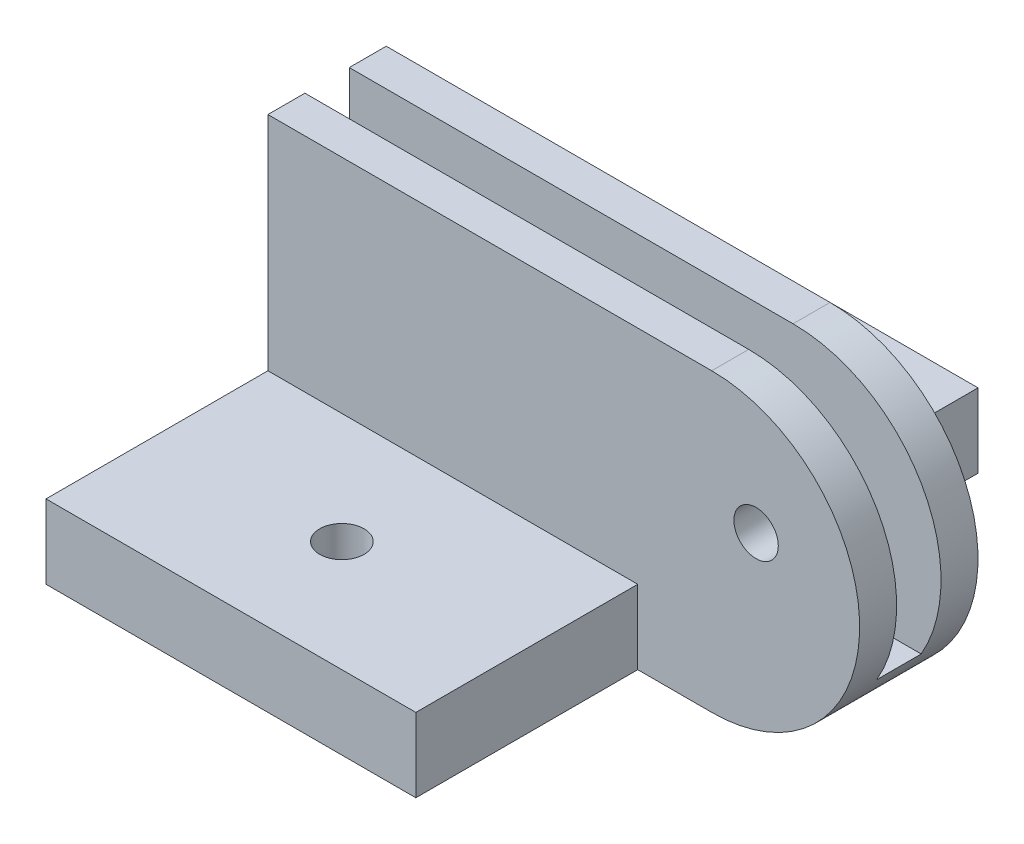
ISO-10303-21;
HEADER;
FILE_DESCRIPTION(('STEP AP214'),'2;1');
FILE_NAME('part.step','',(''),(''),'','','');
FILE_SCHEMA(('AUTOMOTIVE_DESIGN { 1 0 10303 214 1 1 1 1 }'));
ENDSEC;
DATA;
#1=APPLICATION_CONTEXT('core data for automotive mechanical design processes');
#2=APPLICATION_PROTOCOL_DEFINITION('international standard','automotive_design',2000,#1);
#3=PRODUCT_CONTEXT('',#1,'mechanical');
#4=PRODUCT('Part','Part','',(#3));
#5=PRODUCT_RELATED_PRODUCT_CATEGORY('part','',(#4));
#6=PRODUCT_DEFINITION_FORMATION('','',#4);
#7=PRODUCT_DEFINITION_CONTEXT('part definition',#1,'design');
#8=PRODUCT_DEFINITION('design','',#6,#7);
#9=PRODUCT_DEFINITION_SHAPE('','',#8);
#10=(LENGTH_UNIT() NAMED_UNIT(*) SI_UNIT(.MILLI.,.METRE.));
#11=(NAMED_UNIT(*) PLANE_ANGLE_UNIT() SI_UNIT($,.RADIAN.));
#12=(NAMED_UNIT(*) SI_UNIT($,.STERADIAN.) SOLID_ANGLE_UNIT());
#13=UNCERTAINTY_MEASURE_WITH_UNIT(LENGTH_MEASURE(1.E-05),#10,'distance_accuracy_value','');
#14=(GEOMETRIC_REPRESENTATION_CONTEXT(3) GLOBAL_UNCERTAINTY_ASSIGNED_CONTEXT((#13)) GLOBAL_UNIT_ASSIGNED_CONTEXT((#10,
#11,#12)) REPRESENTATION_CONTEXT('',''));
#15=CARTESIAN_POINT('',(0.,0.,0.));
#16=DIRECTION('',(0.,0.,1.));
#17=DIRECTION('',(1.,0.,0.));
#18=AXIS2_PLACEMENT_3D('',#15,#16,#17);
#19=CARTESIAN_POINT('',(-30.,10.,8.));
#20=DIRECTION('',(0.,-1.,0.));
#21=DIRECTION('',(0.,0.,-1.));
#22=AXIS2_PLACEMENT_3D('',#19,#20,#21);
#23=PLANE('',#22);
#24=DIRECTION('',(0.,0.,-1.));
#25=VECTOR('',#24,1.);
#26=CARTESIAN_POINT('',(0.,10.,8.));
#27=LINE('',#26,#25);
#28=CARTESIAN_POINT('',(0.,10.,8.));
#29=VERTEX_POINT('',#28);
#30=CARTESIAN_POINT('',(0.,10.,5.5));
#31=VERTEX_POINT('',#30);
#32=EDGE_CURVE('E240',#29,#31,#27,.T.);
#33=ORIENTED_EDGE('',*,*,#32,.T.);
#34=DIRECTION('',(1.,0.,0.));
#35=VECTOR('',#34,1.);
#36=CARTESIAN_POINT('',(10.,10.,5.5));
#37=LINE('',#36,#35);
#38=CARTESIAN_POINT('',(-30.,10.,5.50000000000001));
#39=VERTEX_POINT('',#38);
#40=EDGE_CURVE('E145',#39,#31,#37,.T.);
#41=ORIENTED_EDGE('',*,*,#40,.F.);
#42=DIRECTION('',(0.,0.,-1.));
#43=VECTOR('',#42,1.);
#44=CARTESIAN_POINT('',(-30.,10.,8.));
#45=LINE('',#44,#43);
#46=CARTESIAN_POINT('',(-30.,10.,8.));
#47=VERTEX_POINT('',#46);
#48=EDGE_CURVE('E237',#47,#39,#45,.T.);
#49=ORIENTED_EDGE('',*,*,#48,.F.);
#50=DIRECTION('',(-1.,0.,0.));
#51=VECTOR('',#50,1.);
#52=CARTESIAN_POINT('',(-30.,10.,8.));
#53=LINE('',#52,#51);
#54=EDGE_CURVE('E225',#29,#47,#53,.T.);
#55=ORIENTED_EDGE('',*,*,#54,.F.);
#56=EDGE_LOOP('',(#33,#41,#49,#55));
#57=FACE_BOUND('',#56,.T.);
#58=ADVANCED_FACE('F36',(#57),#23,.F.);
#59=CARTESIAN_POINT('',(0.,0.,0.));
#60=DIRECTION('',(0.,0.,1.));
#61=DIRECTION('',(1.,0.,0.));
#62=AXIS2_PLACEMENT_3D('',#59,#60,#61);
#63=PLANE('',#62);
#64=CARTESIAN_POINT('',(3.,2.,0.));
#65=DIRECTION('',(0.,0.,1.));
#66=DIRECTION('',(1.,0.,0.));
#67=AXIS2_PLACEMENT_3D('',#64,#65,#66);
#68=CIRCLE('',#67,1.5);
#69=CARTESIAN_POINT('',(4.5,2.,0.));
#70=VERTEX_POINT('',#69);
#71=EDGE_CURVE('E163',#70,#70,#68,.T.);
#72=ORIENTED_EDGE('',*,*,#71,.T.);
#73=EDGE_LOOP('',(#72));
#74=FACE_BOUND('',#73,.T.);
#75=DIRECTION('',(0.,-1.,0.));
#76=VECTOR('',#75,1.);
#77=CARTESIAN_POINT('',(-5.,-5.,0.));
#78=LINE('',#77,#76);
#79=CARTESIAN_POINT('',(-5.,-5.,0.));
#80=VERTEX_POINT('',#79);
#81=CARTESIAN_POINT('',(-5.,-10.,0.));
#82=VERTEX_POINT('',#81);
#83=EDGE_CURVE('E188',#80,#82,#78,.T.);
#84=ORIENTED_EDGE('',*,*,#83,.F.);
#85=DIRECTION('',(-1.,0.,0.));
#86=VECTOR('',#85,1.);
#87=CARTESIAN_POINT('',(-30.,-5.,0.));
#88=LINE('',#87,#86);
#89=CARTESIAN_POINT('',(-30.,-5.,0.));
#90=VERTEX_POINT('',#89);
#91=EDGE_CURVE('E176',#80,#90,#88,.T.);
#92=ORIENTED_EDGE('',*,*,#91,.T.);
#93=DIRECTION('',(0.,-1.,0.));
#94=VECTOR('',#93,1.);
#95=CARTESIAN_POINT('',(-30.,10.,0.));
#96=LINE('',#95,#94);
#97=CARTESIAN_POINT('',(-30.,10.,0.));
#98=VERTEX_POINT('',#97);
#99=EDGE_CURVE('E212',#98,#90,#96,.T.);
#100=ORIENTED_EDGE('',*,*,#99,.F.);
#101=DIRECTION('',(-1.,0.,0.));
#102=VECTOR('',#101,1.);
#103=CARTESIAN_POINT('',(-30.,10.,0.));
#104=LINE('',#103,#102);
#105=CARTESIAN_POINT('',(0.,10.,0.));
#106=VERTEX_POINT('',#105);
#107=EDGE_CURVE('E221',#106,#98,#104,.T.);
#108=ORIENTED_EDGE('',*,*,#107,.F.);
#109=CARTESIAN_POINT('',(0.,0.,0.));
#110=DIRECTION('',(0.,0.,1.));
#111=DIRECTION('',(1.,0.,0.));
#112=AXIS2_PLACEMENT_3D('',#109,#110,#111);
#113=CIRCLE('',#112,10.);
#114=CARTESIAN_POINT('',(0.,-10.,0.));
#115=VERTEX_POINT('',#114);
#116=EDGE_CURVE('E232',#115,#106,#113,.T.);
#117=ORIENTED_EDGE('',*,*,#116,.F.);
#118=DIRECTION('',(1.,0.,0.));
#119=VECTOR('',#118,1.);
#120=CARTESIAN_POINT('',(-30.,-10.,0.));
#121=LINE('',#120,#119);
#122=EDGE_CURVE('E230',#82,#115,#121,.T.);
#123=ORIENTED_EDGE('',*,*,#122,.F.);
#124=EDGE_LOOP('',(#84,#92,#100,#108,#117,#123));
#125=FACE_BOUND('',#124,.T.);
#126=ADVANCED_FACE('F261',(#74,#125),#63,.F.);
#127=CARTESIAN_POINT('',(0.,0.,8.));
#128=DIRECTION('',(0.,0.,1.));
#129=DIRECTION('',(1.,0.,0.));
#130=AXIS2_PLACEMENT_3D('',#127,#128,#129);
#131=PLANE('',#130);
#132=CARTESIAN_POINT('',(3.,2.,8.));
#133=DIRECTION('',(0.,0.,1.));
#134=DIRECTION('',(1.,0.,0.));
#135=AXIS2_PLACEMENT_3D('',#132,#133,#134);
#136=CIRCLE('',#135,1.5);
#137=CARTESIAN_POINT('',(4.5,2.,8.));
#138=VERTEX_POINT('',#137);
#139=EDGE_CURVE('E341',#138,#138,#136,.T.);
#140=ORIENTED_EDGE('',*,*,#139,.F.);
#141=EDGE_LOOP('',(#140));
#142=FACE_BOUND('',#141,.T.);
#143=DIRECTION('',(0.,-1.,0.));
#144=VECTOR('',#143,1.);
#145=CARTESIAN_POINT('',(-30.,10.,8.));
#146=LINE('',#145,#144);
#147=CARTESIAN_POINT('',(-30.,-5.,8.));
#148=VERTEX_POINT('',#147);
#149=EDGE_CURVE('E217',#47,#148,#146,.T.);
#150=ORIENTED_EDGE('',*,*,#149,.T.);
#151=DIRECTION('',(1.,0.,0.));
#152=VECTOR('',#151,1.);
#153=CARTESIAN_POINT('',(-5.,-5.,8.));
#154=LINE('',#153,#152);
#155=CARTESIAN_POINT('',(-5.,-5.,8.));
#156=VERTEX_POINT('',#155);
#157=EDGE_CURVE('E194',#148,#156,#154,.T.);
#158=ORIENTED_EDGE('',*,*,#157,.T.);
#159=DIRECTION('',(0.,-1.,0.));
#160=VECTOR('',#159,1.);
#161=CARTESIAN_POINT('',(-5.,-5.,8.));
#162=LINE('',#161,#160);
#163=CARTESIAN_POINT('',(-5.,-10.,8.));
#164=VERTEX_POINT('',#163);
#165=EDGE_CURVE('E204',#156,#164,#162,.T.);
#166=ORIENTED_EDGE('',*,*,#165,.T.);
#167=DIRECTION('',(1.,0.,0.));
#168=VECTOR('',#167,1.);
#169=CARTESIAN_POINT('',(-30.,-10.,8.));
#170=LINE('',#169,#168);
#171=CARTESIAN_POINT('',(0.,-10.,8.));
#172=VERTEX_POINT('',#171);
#173=EDGE_CURVE('E220',#164,#172,#170,.T.);
#174=ORIENTED_EDGE('',*,*,#173,.T.);
#175=CARTESIAN_POINT('',(0.,0.,8.));
#176=DIRECTION('',(0.,0.,1.));
#177=DIRECTION('',(1.,0.,0.));
#178=AXIS2_PLACEMENT_3D('',#175,#176,#177);
#179=CIRCLE('',#178,10.);
#180=EDGE_CURVE('E223',#172,#29,#179,.T.);
#181=ORIENTED_EDGE('',*,*,#180,.T.);
#182=ORIENTED_EDGE('',*,*,#54,.T.);
#183=EDGE_LOOP('',(#150,#158,#166,#174,#181,#182));
#184=FACE_BOUND('',#183,.T.);
#185=ADVANCED_FACE('F279',(#142,#184),#131,.T.);
#186=CARTESIAN_POINT('',(-30.,10.,8.));
#187=DIRECTION('',(1.,0.,0.));
#188=DIRECTION('',(0.,1.,0.));
#189=AXIS2_PLACEMENT_3D('',#186,#187,#188);
#190=PLANE('',#189);
#191=ORIENTED_EDGE('',*,*,#48,.T.);
#192=DIRECTION('',(0.,1.,0.));
#193=VECTOR('',#192,1.);
#194=CARTESIAN_POINT('',(-30.,-5.,5.50000000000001));
#195=LINE('',#194,#193);
#196=CARTESIAN_POINT('',(-30.,-5.,5.50000000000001));
#197=VERTEX_POINT('',#196);
#198=EDGE_CURVE('E152',#197,#39,#195,.T.);
#199=ORIENTED_EDGE('',*,*,#198,.F.);
#200=DIRECTION('',(0.,0.,1.));
#201=VECTOR('',#200,1.);
#202=CARTESIAN_POINT('',(-30.,-5.,5.50000000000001));
#203=LINE('',#202,#201);
#204=CARTESIAN_POINT('',(-30.,-5.,2.50000000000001));
#205=VERTEX_POINT('',#204);
#206=EDGE_CURVE('E142',#205,#197,#203,.T.);
#207=ORIENTED_EDGE('',*,*,#206,.F.);
#208=DIRECTION('',(0.,1.,0.));
#209=VECTOR('',#208,1.);
#210=CARTESIAN_POINT('',(-30.,-5.,2.50000000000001));
#211=LINE('',#210,#209);
#212=CARTESIAN_POINT('',(-30.,10.,2.50000000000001));
#213=VERTEX_POINT('',#212);
#214=EDGE_CURVE('E148',#205,#213,#211,.T.);
#215=ORIENTED_EDGE('',*,*,#214,.T.);
#216=EDGE_CURVE('E227',#213,#98,#45,.T.);
#217=ORIENTED_EDGE('',*,*,#216,.T.);
#218=ORIENTED_EDGE('',*,*,#99,.T.);
#219=DIRECTION('',(0.,0.,-1.));
#220=VECTOR('',#219,1.);
#221=CARTESIAN_POINT('',(-30.,-5.,0.));
#222=LINE('',#221,#220);
#223=CARTESIAN_POINT('',(-30.,-5.,-15.));
#224=VERTEX_POINT('',#223);
#225=EDGE_CURVE('E60',#90,#224,#222,.T.);
#226=ORIENTED_EDGE('',*,*,#225,.T.);
#227=DIRECTION('',(0.,-1.,0.));
#228=VECTOR('',#227,1.);
#229=CARTESIAN_POINT('',(-30.,-5.,-15.));
#230=LINE('',#229,#228);
#231=CARTESIAN_POINT('',(-30.,-10.,-15.));
#232=VERTEX_POINT('',#231);
#233=EDGE_CURVE('E184',#224,#232,#230,.T.);
#234=ORIENTED_EDGE('',*,*,#233,.T.);
#235=DIRECTION('',(0.,0.,-1.));
#236=VECTOR('',#235,1.);
#237=CARTESIAN_POINT('',(-30.,-10.,8.));
#238=LINE('',#237,#236);
#239=CARTESIAN_POINT('',(-30.,-10.,23.));
#240=VERTEX_POINT('',#239);
#241=EDGE_CURVE('E246',#240,#232,#238,.T.);
#242=ORIENTED_EDGE('',*,*,#241,.F.);
#243=DIRECTION('',(0.,-1.,0.));
#244=VECTOR('',#243,1.);
#245=CARTESIAN_POINT('',(-30.,-5.,23.));
#246=LINE('',#245,#244);
#247=CARTESIAN_POINT('',(-30.,-5.,23.));
#248=VERTEX_POINT('',#247);
#249=EDGE_CURVE('E209',#248,#240,#246,.T.);
#250=ORIENTED_EDGE('',*,*,#249,.F.);
#251=DIRECTION('',(0.,0.,-1.));
#252=VECTOR('',#251,1.);
#253=CARTESIAN_POINT('',(-30.,-5.,23.));
#254=LINE('',#253,#252);
#255=EDGE_CURVE('E191',#248,#148,#254,.T.);
#256=ORIENTED_EDGE('',*,*,#255,.T.);
#257=ORIENTED_EDGE('',*,*,#149,.F.);
#258=EDGE_LOOP('',(#191,#199,#207,#215,#217,#218,#226,#234,#242,#250,#256,#257));
#259=FACE_BOUND('',#258,.T.);
#260=ADVANCED_FACE('F38',(#259),#190,.F.);
#261=CARTESIAN_POINT('',(-30.,-10.,8.));
#262=DIRECTION('',(0.,1.,0.));
#263=DIRECTION('',(0.,0.,1.));
#264=AXIS2_PLACEMENT_3D('',#261,#262,#263);
#265=PLANE('',#264);
#266=CARTESIAN_POINT('',(-17.5,-10.,-7.5));
#267=DIRECTION('',(0.,1.,0.));
#268=DIRECTION('',(0.,0.,1.));
#269=AXIS2_PLACEMENT_3D('',#266,#267,#268);
#270=CIRCLE('',#269,1.5);
#271=CARTESIAN_POINT('',(-17.5,-10.,-6.));
#272=VERTEX_POINT('',#271);
#273=EDGE_CURVE('E327',#272,#272,#270,.T.);
#274=ORIENTED_EDGE('',*,*,#273,.T.);
#275=EDGE_LOOP('',(#274));
#276=FACE_BOUND('',#275,.T.);
#277=CARTESIAN_POINT('',(-17.5,-10.,15.5));
#278=DIRECTION('',(0.,1.,0.));
#279=DIRECTION('',(0.,0.,1.));
#280=AXIS2_PLACEMENT_3D('',#277,#278,#279);
#281=CIRCLE('',#280,1.5);
#282=CARTESIAN_POINT('',(-17.5,-10.,17.));
#283=VERTEX_POINT('',#282);
#284=EDGE_CURVE('E330',#283,#283,#281,.T.);
#285=ORIENTED_EDGE('',*,*,#284,.T.);
#286=EDGE_LOOP('',(#285));
#287=FACE_BOUND('',#286,.T.);
#288=ORIENTED_EDGE('',*,*,#241,.T.);
#289=DIRECTION('',(1.,0.,0.));
#290=VECTOR('',#289,1.);
#291=CARTESIAN_POINT('',(-30.,-10.,-15.));
#292=LINE('',#291,#290);
#293=CARTESIAN_POINT('',(-5.,-10.,-15.));
#294=VERTEX_POINT('',#293);
#295=EDGE_CURVE('E168',#232,#294,#292,.T.);
#296=ORIENTED_EDGE('',*,*,#295,.T.);
#297=DIRECTION('',(0.,0.,1.));
#298=VECTOR('',#297,1.);
#299=CARTESIAN_POINT('',(-5.,-10.,0.));
#300=LINE('',#299,#298);
#301=EDGE_CURVE('E173',#294,#82,#300,.T.);
#302=ORIENTED_EDGE('',*,*,#301,.T.);
#303=ORIENTED_EDGE('',*,*,#122,.T.);
#304=DIRECTION('',(0.,0.,-1.));
#305=VECTOR('',#304,1.);
#306=CARTESIAN_POINT('',(0.,-10.,8.));
#307=LINE('',#306,#305);
#308=EDGE_CURVE('E243',#172,#115,#307,.T.);
#309=ORIENTED_EDGE('',*,*,#308,.F.);
#310=ORIENTED_EDGE('',*,*,#173,.F.);
#311=DIRECTION('',(0.,0.,1.));
#312=VECTOR('',#311,1.);
#313=CARTESIAN_POINT('',(-5.,-10.,23.));
#314=LINE('',#313,#312);
#315=CARTESIAN_POINT('',(-5.,-10.,23.));
#316=VERTEX_POINT('',#315);
#317=EDGE_CURVE('E187',#164,#316,#314,.T.);
#318=ORIENTED_EDGE('',*,*,#317,.T.);
#319=DIRECTION('',(-1.,0.,0.));
#320=VECTOR('',#319,1.);
#321=CARTESIAN_POINT('',(-30.,-10.,23.));
#322=LINE('',#321,#320);
#323=EDGE_CURVE('E195',#316,#240,#322,.T.);
#324=ORIENTED_EDGE('',*,*,#323,.T.);
#325=EDGE_LOOP('',(#288,#296,#302,#303,#309,#310,#318,#324));
#326=FACE_BOUND('',#325,.T.);
#327=ADVANCED_FACE('F267',(#276,#287,#326),#265,.F.);
#328=CARTESIAN_POINT('',(0.,0.,8.));
#329=DIRECTION('',(0.,0.,-1.));
#330=DIRECTION('',(-1.,0.,0.));
#331=AXIS2_PLACEMENT_3D('',#328,#329,#330);
#332=CYLINDRICAL_SURFACE('',#331,10.);
#333=CARTESIAN_POINT('',(0.,0.,5.5));
#334=DIRECTION('',(0.,0.,1.));
#335=DIRECTION('',(1.,0.,0.));
#336=AXIS2_PLACEMENT_3D('',#333,#334,#335);
#337=CIRCLE('',#336,10.);
#338=CARTESIAN_POINT('',(8.66025403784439,-5.,5.5));
#339=VERTEX_POINT('',#338);
#340=EDGE_CURVE('E166',#339,#31,#337,.T.);
#341=ORIENTED_EDGE('',*,*,#340,.T.);
#342=ORIENTED_EDGE('',*,*,#32,.F.);
#343=ORIENTED_EDGE('',*,*,#180,.F.);
#344=ORIENTED_EDGE('',*,*,#308,.T.);
#345=ORIENTED_EDGE('',*,*,#116,.T.);
#346=CARTESIAN_POINT('',(0.,10.,2.5));
#347=VERTEX_POINT('',#346);
#348=EDGE_CURVE('E239',#347,#106,#27,.T.);
#349=ORIENTED_EDGE('',*,*,#348,.F.);
#350=CARTESIAN_POINT('',(0.,0.,2.5));
#351=DIRECTION('',(0.,0.,-1.));
#352=DIRECTION('',(-1.,0.,0.));
#353=AXIS2_PLACEMENT_3D('',#350,#351,#352);
#354=CIRCLE('',#353,10.);
#355=CARTESIAN_POINT('',(8.66025403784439,-5.,2.5));
#356=VERTEX_POINT('',#355);
#357=EDGE_CURVE('E52',#347,#356,#354,.T.);
#358=ORIENTED_EDGE('',*,*,#357,.T.);
#359=DIRECTION('',(0.,0.,-1.));
#360=VECTOR('',#359,1.);
#361=CARTESIAN_POINT('',(8.66025403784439,-5.,8.));
#362=LINE('',#361,#360);
#363=EDGE_CURVE('E11',#339,#356,#362,.T.);
#364=ORIENTED_EDGE('',*,*,#363,.F.);
#365=EDGE_LOOP('',(#341,#342,#343,#344,#345,#349,#358,#364));
#366=FACE_BOUND('',#365,.T.);
#367=ADVANCED_FACE('F252',(#366),#332,.T.);
#368=ORIENTED_EDGE('',*,*,#216,.F.);
#369=DIRECTION('',(1.,0.,0.));
#370=VECTOR('',#369,1.);
#371=CARTESIAN_POINT('',(-30.,10.,2.50000000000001));
#372=LINE('',#371,#370);
#373=EDGE_CURVE('E45',#213,#347,#372,.T.);
#374=ORIENTED_EDGE('',*,*,#373,.T.);
#375=ORIENTED_EDGE('',*,*,#348,.T.);
#376=ORIENTED_EDGE('',*,*,#107,.T.);
#377=EDGE_LOOP('',(#368,#374,#375,#376));
#378=FACE_BOUND('',#377,.T.);
#379=ADVANCED_FACE('F250',(#378),#23,.F.);
#380=CARTESIAN_POINT('',(-30.,-5.,23.));
#381=DIRECTION('',(0.,0.,1.));
#382=DIRECTION('',(1.,0.,0.));
#383=AXIS2_PLACEMENT_3D('',#380,#381,#382);
#384=PLANE('',#383);
#385=ORIENTED_EDGE('',*,*,#323,.F.);
#386=DIRECTION('',(0.,-1.,0.));
#387=VECTOR('',#386,1.);
#388=CARTESIAN_POINT('',(-5.,-5.,23.));
#389=LINE('',#388,#387);
#390=CARTESIAN_POINT('',(-5.,-5.,23.));
#391=VERTEX_POINT('',#390);
#392=EDGE_CURVE('E213',#391,#316,#389,.T.);
#393=ORIENTED_EDGE('',*,*,#392,.F.);
#394=DIRECTION('',(-1.,0.,0.));
#395=VECTOR('',#394,1.);
#396=CARTESIAN_POINT('',(-30.,-5.,23.));
#397=LINE('',#396,#395);
#398=EDGE_CURVE('E201',#391,#248,#397,.T.);
#399=ORIENTED_EDGE('',*,*,#398,.T.);
#400=ORIENTED_EDGE('',*,*,#249,.T.);
#401=EDGE_LOOP('',(#385,#393,#399,#400));
#402=FACE_BOUND('',#401,.T.);
#403=ADVANCED_FACE('F271',(#402),#384,.T.);
#404=CARTESIAN_POINT('',(-5.,-5.,23.));
#405=DIRECTION('',(1.,0.,0.));
#406=DIRECTION('',(0.,0.,-1.));
#407=AXIS2_PLACEMENT_3D('',#404,#405,#406);
#408=PLANE('',#407);
#409=ORIENTED_EDGE('',*,*,#317,.F.);
#410=ORIENTED_EDGE('',*,*,#165,.F.);
#411=DIRECTION('',(0.,0.,1.));
#412=VECTOR('',#411,1.);
#413=CARTESIAN_POINT('',(-5.,-5.,23.));
#414=LINE('',#413,#412);
#415=EDGE_CURVE('E198',#156,#391,#414,.T.);
#416=ORIENTED_EDGE('',*,*,#415,.T.);
#417=ORIENTED_EDGE('',*,*,#392,.T.);
#418=EDGE_LOOP('',(#409,#410,#416,#417));
#419=FACE_BOUND('',#418,.T.);
#420=ADVANCED_FACE('F315',(#419),#408,.T.);
#421=CARTESIAN_POINT('',(0.,-5.,0.));
#422=DIRECTION('',(0.,1.,0.));
#423=DIRECTION('',(0.,0.,1.));
#424=AXIS2_PLACEMENT_3D('',#421,#422,#423);
#425=PLANE('',#424);
#426=CARTESIAN_POINT('',(-17.5,-5.,15.5));
#427=DIRECTION('',(0.,1.,0.));
#428=DIRECTION('',(0.,0.,1.));
#429=AXIS2_PLACEMENT_3D('',#426,#427,#428);
#430=CIRCLE('',#429,1.5);
#431=CARTESIAN_POINT('',(-17.5,-5.,17.));
#432=VERTEX_POINT('',#431);
#433=EDGE_CURVE('E333',#432,#432,#430,.T.);
#434=ORIENTED_EDGE('',*,*,#433,.F.);
#435=EDGE_LOOP('',(#434));
#436=FACE_BOUND('',#435,.T.);
#437=ORIENTED_EDGE('',*,*,#255,.F.);
#438=ORIENTED_EDGE('',*,*,#398,.F.);
#439=ORIENTED_EDGE('',*,*,#415,.F.);
#440=ORIENTED_EDGE('',*,*,#157,.F.);
#441=EDGE_LOOP('',(#437,#438,#439,#440));
#442=FACE_BOUND('',#441,.T.);
#443=ADVANCED_FACE('F276',(#436,#442),#425,.T.);
#444=CARTESIAN_POINT('',(-30.,-5.,-15.));
#445=DIRECTION('',(0.,0.,-1.));
#446=DIRECTION('',(-1.,0.,0.));
#447=AXIS2_PLACEMENT_3D('',#444,#445,#446);
#448=PLANE('',#447);
#449=ORIENTED_EDGE('',*,*,#295,.F.);
#450=ORIENTED_EDGE('',*,*,#233,.F.);
#451=DIRECTION('',(1.,0.,0.));
#452=VECTOR('',#451,1.);
#453=CARTESIAN_POINT('',(-30.,-5.,-15.));
#454=LINE('',#453,#452);
#455=CARTESIAN_POINT('',(-5.,-5.,-15.));
#456=VERTEX_POINT('',#455);
#457=EDGE_CURVE('E169',#224,#456,#454,.T.);
#458=ORIENTED_EDGE('',*,*,#457,.T.);
#459=DIRECTION('',(0.,-1.,0.));
#460=VECTOR('',#459,1.);
#461=CARTESIAN_POINT('',(-5.,-5.,-15.));
#462=LINE('',#461,#460);
#463=EDGE_CURVE('E179',#456,#294,#462,.T.);
#464=ORIENTED_EDGE('',*,*,#463,.T.);
#465=EDGE_LOOP('',(#449,#450,#458,#464));
#466=FACE_BOUND('',#465,.T.);
#467=ADVANCED_FACE('F264',(#466),#448,.T.);
#468=CARTESIAN_POINT('',(-5.,-5.,0.));
#469=DIRECTION('',(1.,0.,0.));
#470=DIRECTION('',(0.,0.,-1.));
#471=AXIS2_PLACEMENT_3D('',#468,#469,#470);
#472=PLANE('',#471);
#473=ORIENTED_EDGE('',*,*,#301,.F.);
#474=ORIENTED_EDGE('',*,*,#463,.F.);
#475=DIRECTION('',(0.,0.,1.));
#476=VECTOR('',#475,1.);
#477=CARTESIAN_POINT('',(-5.,-5.,0.));
#478=LINE('',#477,#476);
#479=EDGE_CURVE('E172',#456,#80,#478,.T.);
#480=ORIENTED_EDGE('',*,*,#479,.T.);
#481=ORIENTED_EDGE('',*,*,#83,.T.);
#482=EDGE_LOOP('',(#473,#474,#480,#481));
#483=FACE_BOUND('',#482,.T.);
#484=ADVANCED_FACE('F288',(#483),#472,.T.);
#485=CARTESIAN_POINT('',(0.,-5.,0.));
#486=DIRECTION('',(0.,1.,0.));
#487=DIRECTION('',(0.,0.,1.));
#488=AXIS2_PLACEMENT_3D('',#485,#486,#487);
#489=PLANE('',#488);
#490=CARTESIAN_POINT('',(-17.5,-5.,-7.5));
#491=DIRECTION('',(0.,1.,0.));
#492=DIRECTION('',(0.,0.,1.));
#493=AXIS2_PLACEMENT_3D('',#490,#491,#492);
#494=CIRCLE('',#493,1.5);
#495=CARTESIAN_POINT('',(-17.5,-5.,-6.));
#496=VERTEX_POINT('',#495);
#497=EDGE_CURVE('E332',#496,#496,#494,.T.);
#498=ORIENTED_EDGE('',*,*,#497,.F.);
#499=EDGE_LOOP('',(#498));
#500=FACE_BOUND('',#499,.T.);
#501=ORIENTED_EDGE('',*,*,#457,.F.);
#502=ORIENTED_EDGE('',*,*,#225,.F.);
#503=ORIENTED_EDGE('',*,*,#91,.F.);
#504=ORIENTED_EDGE('',*,*,#479,.F.);
#505=EDGE_LOOP('',(#501,#502,#503,#504));
#506=FACE_BOUND('',#505,.T.);
#507=ADVANCED_FACE('F290',(#500,#506),#489,.T.);
#508=CARTESIAN_POINT('',(0.,-5.,0.));
#509=DIRECTION('',(0.,1.,0.));
#510=DIRECTION('',(0.,0.,1.));
#511=AXIS2_PLACEMENT_3D('',#508,#509,#510);
#512=PLANE('',#511);
#513=ORIENTED_EDGE('',*,*,#363,.T.);
#514=DIRECTION('',(-1.,0.,0.));
#515=VECTOR('',#514,1.);
#516=CARTESIAN_POINT('',(10.,-5.,2.5));
#517=LINE('',#516,#515);
#518=EDGE_CURVE('E137',#356,#205,#517,.T.);
#519=ORIENTED_EDGE('',*,*,#518,.T.);
#520=ORIENTED_EDGE('',*,*,#206,.T.);
#521=DIRECTION('',(1.,0.,0.));
#522=VECTOR('',#521,1.);
#523=CARTESIAN_POINT('',(10.,-5.,5.5));
#524=LINE('',#523,#522);
#525=EDGE_CURVE('E153',#197,#339,#524,.T.);
#526=ORIENTED_EDGE('',*,*,#525,.T.);
#527=EDGE_LOOP('',(#513,#519,#520,#526));
#528=FACE_BOUND('',#527,.T.);
#529=ADVANCED_FACE('F139',(#528),#512,.T.);
#530=CARTESIAN_POINT('',(10.,-5.,5.5));
#531=DIRECTION('',(0.,0.,1.));
#532=DIRECTION('',(1.,0.,0.));
#533=AXIS2_PLACEMENT_3D('',#530,#531,#532);
#534=PLANE('',#533);
#535=CARTESIAN_POINT('',(3.,2.,5.5));
#536=DIRECTION('',(0.,0.,1.));
#537=DIRECTION('',(1.,0.,0.));
#538=AXIS2_PLACEMENT_3D('',#535,#536,#537);
#539=CIRCLE('',#538,1.5);
#540=CARTESIAN_POINT('',(4.5,2.,5.5));
#541=VERTEX_POINT('',#540);
#542=EDGE_CURVE('E344',#541,#541,#539,.T.);
#543=ORIENTED_EDGE('',*,*,#542,.T.);
#544=EDGE_LOOP('',(#543));
#545=FACE_BOUND('',#544,.T.);
#546=ORIENTED_EDGE('',*,*,#340,.F.);
#547=ORIENTED_EDGE('',*,*,#525,.F.);
#548=ORIENTED_EDGE('',*,*,#198,.T.);
#549=ORIENTED_EDGE('',*,*,#40,.T.);
#550=EDGE_LOOP('',(#546,#547,#548,#549));
#551=FACE_BOUND('',#550,.T.);
#552=ADVANCED_FACE('F286',(#545,#551),#534,.F.);
#553=CARTESIAN_POINT('',(10.,-5.,2.5));
#554=DIRECTION('',(0.,0.,-1.));
#555=DIRECTION('',(-1.,0.,0.));
#556=AXIS2_PLACEMENT_3D('',#553,#554,#555);
#557=PLANE('',#556);
#558=CARTESIAN_POINT('',(3.,2.,2.5));
#559=DIRECTION('',(0.,0.,-1.));
#560=DIRECTION('',(-1.,0.,0.));
#561=AXIS2_PLACEMENT_3D('',#558,#559,#560);
#562=CIRCLE('',#561,1.5);
#563=CARTESIAN_POINT('',(1.5,2.,2.5));
#564=VERTEX_POINT('',#563);
#565=EDGE_CURVE('E40',#564,#564,#562,.T.);
#566=ORIENTED_EDGE('',*,*,#565,.T.);
#567=EDGE_LOOP('',(#566));
#568=FACE_BOUND('',#567,.T.);
#569=ORIENTED_EDGE('',*,*,#373,.F.);
#570=ORIENTED_EDGE('',*,*,#214,.F.);
#571=ORIENTED_EDGE('',*,*,#518,.F.);
#572=ORIENTED_EDGE('',*,*,#357,.F.);
#573=EDGE_LOOP('',(#569,#570,#571,#572));
#574=FACE_BOUND('',#573,.T.);
#575=ADVANCED_FACE('F149',(#568,#574),#557,.F.);
#576=CARTESIAN_POINT('',(3.,2.,-15.));
#577=DIRECTION('',(0.,0.,1.));
#578=DIRECTION('',(1.,0.,0.));
#579=AXIS2_PLACEMENT_3D('',#576,#577,#578);
#580=CYLINDRICAL_SURFACE('',#579,1.5);
#581=ORIENTED_EDGE('',*,*,#565,.F.);
#582=EDGE_LOOP('',(#581));
#583=FACE_BOUND('',#582,.T.);
#584=ORIENTED_EDGE('',*,*,#71,.F.);
#585=EDGE_LOOP('',(#584));
#586=FACE_BOUND('',#585,.T.);
#587=ADVANCED_FACE('F349',(#583,#586),#580,.F.);
#588=ORIENTED_EDGE('',*,*,#139,.T.);
#589=EDGE_LOOP('',(#588));
#590=FACE_BOUND('',#589,.T.);
#591=ORIENTED_EDGE('',*,*,#542,.F.);
#592=EDGE_LOOP('',(#591));
#593=FACE_BOUND('',#592,.T.);
#594=ADVANCED_FACE('F351',(#590,#593),#580,.F.);
#595=CARTESIAN_POINT('',(-17.5,-10.,-7.5));
#596=DIRECTION('',(0.,1.,0.));
#597=DIRECTION('',(0.,0.,1.));
#598=AXIS2_PLACEMENT_3D('',#595,#596,#597);
#599=CYLINDRICAL_SURFACE('',#598,1.5);
#600=ORIENTED_EDGE('',*,*,#273,.F.);
#601=EDGE_LOOP('',(#600));
#602=FACE_BOUND('',#601,.T.);
#603=ORIENTED_EDGE('',*,*,#497,.T.);
#604=EDGE_LOOP('',(#603));
#605=FACE_BOUND('',#604,.T.);
#606=ADVANCED_FACE('F358',(#602,#605),#599,.F.);
#607=CARTESIAN_POINT('',(-17.5,-10.,15.5));
#608=DIRECTION('',(0.,1.,0.));
#609=DIRECTION('',(0.,0.,1.));
#610=AXIS2_PLACEMENT_3D('',#607,#608,#609);
#611=CYLINDRICAL_SURFACE('',#610,1.5);
#612=ORIENTED_EDGE('',*,*,#284,.F.);
#613=EDGE_LOOP('',(#612));
#614=FACE_BOUND('',#613,.T.);
#615=ORIENTED_EDGE('',*,*,#433,.T.);
#616=EDGE_LOOP('',(#615));
#617=FACE_BOUND('',#616,.T.);
#618=ADVANCED_FACE('F363',(#614,#617),#611,.F.);
#619=CLOSED_SHELL('',(#58,#126,#185,#260,#327,#367,#379,#403,#420,#443,#467,#484,#507,#529,#552,
#575,#587,#594,#606,#618));
#620=MANIFOLD_SOLID_BREP('B2',#619);
#621=ADVANCED_BREP_SHAPE_REPRESENTATION('',(#18,#620),#14);
#622=SHAPE_DEFINITION_REPRESENTATION(#9,#621);
ENDSEC;
END-ISO-10303-21;
